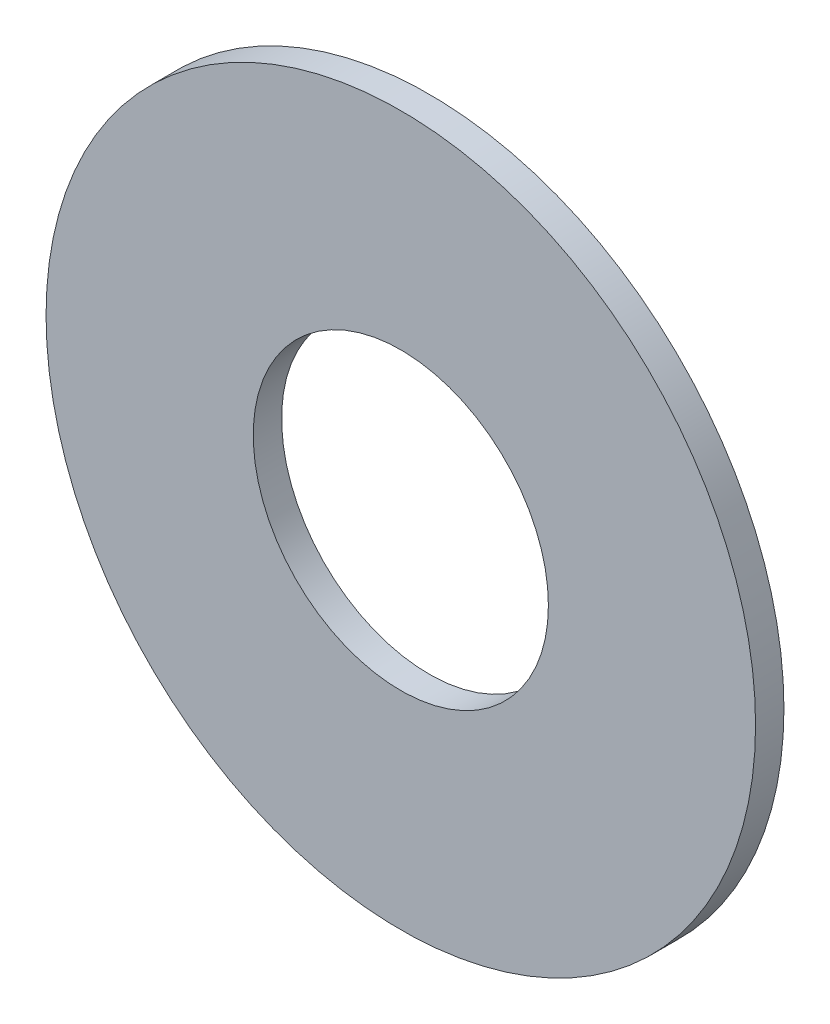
ISO-10303-21;
HEADER;
FILE_DESCRIPTION(('STEP AP214'),'2;1');
FILE_NAME('part.step','',(''),(''),'','','');
FILE_SCHEMA(('AUTOMOTIVE_DESIGN { 1 0 10303 214 1 1 1 1 }'));
ENDSEC;
DATA;
#1=APPLICATION_CONTEXT('core data for automotive mechanical design processes');
#2=APPLICATION_PROTOCOL_DEFINITION('international standard','automotive_design',2000,#1);
#3=PRODUCT_CONTEXT('',#1,'mechanical');
#4=PRODUCT('Part','Part','',(#3));
#5=PRODUCT_RELATED_PRODUCT_CATEGORY('part','',(#4));
#6=PRODUCT_DEFINITION_FORMATION('','',#4);
#7=PRODUCT_DEFINITION_CONTEXT('part definition',#1,'design');
#8=PRODUCT_DEFINITION('design','',#6,#7);
#9=PRODUCT_DEFINITION_SHAPE('','',#8);
#10=(LENGTH_UNIT() NAMED_UNIT(*) SI_UNIT(.MILLI.,.METRE.));
#11=(NAMED_UNIT(*) PLANE_ANGLE_UNIT() SI_UNIT($,.RADIAN.));
#12=(NAMED_UNIT(*) SI_UNIT($,.STERADIAN.) SOLID_ANGLE_UNIT());
#13=UNCERTAINTY_MEASURE_WITH_UNIT(LENGTH_MEASURE(1.E-05),#10,'distance_accuracy_value','');
#14=(GEOMETRIC_REPRESENTATION_CONTEXT(3) GLOBAL_UNCERTAINTY_ASSIGNED_CONTEXT((#13)) GLOBAL_UNIT_ASSIGNED_CONTEXT((#10,
#11,#12)) REPRESENTATION_CONTEXT('',''));
#15=CARTESIAN_POINT('',(0.,0.,0.));
#16=DIRECTION('',(0.,0.,1.));
#17=DIRECTION('',(1.,0.,0.));
#18=AXIS2_PLACEMENT_3D('',#15,#16,#17);
#19=CARTESIAN_POINT('',(0.,0.,-0.762));
#20=DIRECTION('',(0.,0.,1.));
#21=DIRECTION('',(1.,0.,0.));
#22=AXIS2_PLACEMENT_3D('',#19,#20,#21);
#23=CYLINDRICAL_SURFACE('',#22,9.525);
#24=CARTESIAN_POINT('',(0.,0.,-0.762));
#25=DIRECTION('',(0.,0.,1.));
#26=DIRECTION('',(1.,0.,0.));
#27=AXIS2_PLACEMENT_3D('',#24,#25,#26);
#28=CIRCLE('',#27,9.525);
#29=CARTESIAN_POINT('',(9.525,0.,-0.762));
#30=VERTEX_POINT('',#29);
#31=EDGE_CURVE('E10',#30,#30,#28,.T.);
#32=CARTESIAN_POINT('',(0.,0.,0.));
#33=DIRECTION('',(0.,0.,1.));
#34=DIRECTION('',(1.,0.,0.));
#35=AXIS2_PLACEMENT_3D('',#32,#33,#34);
#36=CIRCLE('',#35,9.525);
#37=CARTESIAN_POINT('',(9.525,0.,0.));
#38=VERTEX_POINT('',#37);
#39=EDGE_CURVE('E34',#38,#38,#36,.T.);
#40=CARTESIAN_POINT('',(9.525,0.,-0.762));
#41=CARTESIAN_POINT('',(9.525,0.,-0.7540625));
#42=CARTESIAN_POINT('',(9.525,0.,-0.746125));
#43=CARTESIAN_POINT('',(9.525,0.,-0.73025));
#44=CARTESIAN_POINT('',(9.525,0.,-0.7223125));
#45=CARTESIAN_POINT('',(9.525,0.,-0.7064375));
#46=CARTESIAN_POINT('',(9.525,0.,-0.6985));
#47=CARTESIAN_POINT('',(9.525,0.,-0.682625));
#48=CARTESIAN_POINT('',(9.525,0.,-0.6746875));
#49=CARTESIAN_POINT('',(9.525,0.,-0.6588125));
#50=CARTESIAN_POINT('',(9.525,0.,-0.650875));
#51=CARTESIAN_POINT('',(9.525,0.,-0.635));
#52=CARTESIAN_POINT('',(9.525,0.,-0.6270625));
#53=CARTESIAN_POINT('',(9.525,0.,-0.6111875));
#54=CARTESIAN_POINT('',(9.525,0.,-0.60325));
#55=CARTESIAN_POINT('',(9.525,0.,-0.587375));
#56=CARTESIAN_POINT('',(9.525,0.,-0.5794375));
#57=CARTESIAN_POINT('',(9.525,0.,-0.5635625));
#58=CARTESIAN_POINT('',(9.525,0.,-0.555625));
#59=CARTESIAN_POINT('',(9.525,0.,-0.53975));
#60=CARTESIAN_POINT('',(9.525,0.,-0.5318125));
#61=CARTESIAN_POINT('',(9.525,0.,-0.5159375));
#62=CARTESIAN_POINT('',(9.525,0.,-0.508));
#63=CARTESIAN_POINT('',(9.525,0.,-0.492125));
#64=CARTESIAN_POINT('',(9.525,0.,-0.4841875));
#65=CARTESIAN_POINT('',(9.525,0.,-0.4683125));
#66=CARTESIAN_POINT('',(9.525,0.,-0.460375));
#67=CARTESIAN_POINT('',(9.525,0.,-0.4445));
#68=CARTESIAN_POINT('',(9.525,0.,-0.4365625));
#69=CARTESIAN_POINT('',(9.525,0.,-0.4206875));
#70=CARTESIAN_POINT('',(9.525,0.,-0.41275));
#71=CARTESIAN_POINT('',(9.525,0.,-0.396875));
#72=CARTESIAN_POINT('',(9.525,0.,-0.3889375));
#73=CARTESIAN_POINT('',(9.525,0.,-0.3730625));
#74=CARTESIAN_POINT('',(9.525,0.,-0.365125));
#75=CARTESIAN_POINT('',(9.525,0.,-0.34925));
#76=CARTESIAN_POINT('',(9.525,0.,-0.3413125));
#77=CARTESIAN_POINT('',(9.525,0.,-0.3254375));
#78=CARTESIAN_POINT('',(9.525,0.,-0.3175));
#79=CARTESIAN_POINT('',(9.525,0.,-0.301625));
#80=CARTESIAN_POINT('',(9.525,0.,-0.2936875));
#81=CARTESIAN_POINT('',(9.525,0.,-0.2778125));
#82=CARTESIAN_POINT('',(9.525,0.,-0.269875));
#83=CARTESIAN_POINT('',(9.525,0.,-0.254));
#84=CARTESIAN_POINT('',(9.525,0.,-0.2460625));
#85=CARTESIAN_POINT('',(9.525,0.,-0.2301875));
#86=CARTESIAN_POINT('',(9.525,0.,-0.22225));
#87=CARTESIAN_POINT('',(9.525,0.,-0.206375));
#88=CARTESIAN_POINT('',(9.525,0.,-0.1984375));
#89=CARTESIAN_POINT('',(9.525,0.,-0.1825625));
#90=CARTESIAN_POINT('',(9.525,0.,-0.174625));
#91=CARTESIAN_POINT('',(9.525,0.,-0.15875));
#92=CARTESIAN_POINT('',(9.525,0.,-0.1508125));
#93=CARTESIAN_POINT('',(9.525,0.,-0.1349375));
#94=CARTESIAN_POINT('',(9.525,0.,-0.127));
#95=CARTESIAN_POINT('',(9.525,0.,-0.111125));
#96=CARTESIAN_POINT('',(9.525,0.,-0.1031875));
#97=CARTESIAN_POINT('',(9.525,0.,-0.0873125));
#98=CARTESIAN_POINT('',(9.525,0.,-0.079375));
#99=CARTESIAN_POINT('',(9.525,0.,-0.0635));
#100=CARTESIAN_POINT('',(9.525,0.,-0.0555625));
#101=CARTESIAN_POINT('',(9.525,0.,-0.0396875));
#102=CARTESIAN_POINT('',(9.525,0.,-0.03175));
#103=CARTESIAN_POINT('',(9.525,0.,-0.015875));
#104=CARTESIAN_POINT('',(9.525,0.,-0.00793749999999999));
#105=CARTESIAN_POINT('',(9.525,0.,0.));
#106=B_SPLINE_CURVE_WITH_KNOTS('',3,(#40,#41,#42,#43,#44,#45,#46,#47,#48,#49,#50,#51,#52,#53,
#54,#55,#56,#57,#58,#59,#60,#61,#62,#63,#64,#65,#66,#67,#68,#69,#70,#71,#72,#73,#74,#75,#76,#77,
#78,#79,#80,#81,#82,#83,#84,#85,#86,#87,#88,#89,#90,#91,#92,#93,#94,#95,#96,#97,#98,#99,#100,
#101,#102,#103,#104,#105),.UNSPECIFIED.,.F.,.F.,(4,2,2,2,2,2,2,2,2,2,2,2,2,2,2,2,2,2,2,2,2,2,2,
2,2,2,2,2,2,2,2,2,4),(0.,0.0238125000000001,0.047625,0.0714375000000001,0.0952500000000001,
0.1190625,0.142875,0.1666875,0.1905,0.2143125,0.238125,0.2619375,0.28575,0.3095625,0.333375,
0.3571875,0.381,0.4048125,0.428625,0.4524375,0.47625,0.5000625,0.523875,0.5476875,0.5715,
0.5953125,0.619125,0.6429375,0.66675,0.6905625,0.714375,0.7381875,0.762),.UNSPECIFIED.);
#107=EDGE_CURVE('BSEAM28',#30,#38,#106,.T.);
#108=ORIENTED_EDGE('',*,*,#31,.T.);
#109=ORIENTED_EDGE('',*,*,#39,.F.);
#110=ORIENTED_EDGE('',*,*,#107,.T.);
#111=ORIENTED_EDGE('',*,*,#107,.F.);
#112=EDGE_LOOP('',(#108,#110,#109,#111));
#113=FACE_BOUND('',#112,.T.);
#114=ADVANCED_FACE('F28',(#113),#23,.T.);
#115=CARTESIAN_POINT('',(0.,0.,-0.762));
#116=DIRECTION('',(0.,0.,1.));
#117=DIRECTION('',(1.,0.,0.));
#118=AXIS2_PLACEMENT_3D('',#115,#116,#117);
#119=PLANE('',#118);
#120=CARTESIAN_POINT('',(0.,0.,-0.762));
#121=DIRECTION('',(0.,0.,1.));
#122=DIRECTION('',(1.,0.,0.));
#123=AXIS2_PLACEMENT_3D('',#120,#121,#122);
#124=CIRCLE('',#123,3.9624);
#125=CARTESIAN_POINT('',(3.9624,0.,-0.762));
#126=VERTEX_POINT('',#125);
#127=EDGE_CURVE('E38',#126,#126,#124,.T.);
#128=ORIENTED_EDGE('',*,*,#127,.T.);
#129=EDGE_LOOP('',(#128));
#130=FACE_BOUND('',#129,.T.);
#131=ORIENTED_EDGE('',*,*,#31,.F.);
#132=EDGE_LOOP('',(#131));
#133=FACE_BOUND('',#132,.T.);
#134=ADVANCED_FACE('F52',(#130,#133),#119,.F.);
#135=CARTESIAN_POINT('',(0.,0.,0.));
#136=DIRECTION('',(0.,0.,1.));
#137=DIRECTION('',(1.,0.,0.));
#138=AXIS2_PLACEMENT_3D('',#135,#136,#137);
#139=PLANE('',#138);
#140=CARTESIAN_POINT('',(0.,0.,0.));
#141=DIRECTION('',(0.,0.,1.));
#142=DIRECTION('',(1.,0.,0.));
#143=AXIS2_PLACEMENT_3D('',#140,#141,#142);
#144=CIRCLE('',#143,3.9624);
#145=CARTESIAN_POINT('',(3.9624,0.,0.));
#146=VERTEX_POINT('',#145);
#147=EDGE_CURVE('E42',#146,#146,#144,.T.);
#148=ORIENTED_EDGE('',*,*,#147,.F.);
#149=EDGE_LOOP('',(#148));
#150=FACE_BOUND('',#149,.T.);
#151=ORIENTED_EDGE('',*,*,#39,.T.);
#152=EDGE_LOOP('',(#151));
#153=FACE_BOUND('',#152,.T.);
#154=ADVANCED_FACE('F50',(#150,#153),#139,.T.);
#155=CARTESIAN_POINT('',(0.,0.,-0.762));
#156=DIRECTION('',(0.,0.,1.));
#157=DIRECTION('',(1.,0.,0.));
#158=AXIS2_PLACEMENT_3D('',#155,#156,#157);
#159=CYLINDRICAL_SURFACE('',#158,3.9624);
#160=CARTESIAN_POINT('',(3.9624,0.,-0.762));
#161=CARTESIAN_POINT('',(3.9624,0.,-0.7540625));
#162=CARTESIAN_POINT('',(3.9624,0.,-0.746125));
#163=CARTESIAN_POINT('',(3.9624,0.,-0.73025));
#164=CARTESIAN_POINT('',(3.9624,0.,-0.7223125));
#165=CARTESIAN_POINT('',(3.9624,0.,-0.7064375));
#166=CARTESIAN_POINT('',(3.9624,0.,-0.6985));
#167=CARTESIAN_POINT('',(3.9624,0.,-0.682625));
#168=CARTESIAN_POINT('',(3.9624,0.,-0.6746875));
#169=CARTESIAN_POINT('',(3.9624,0.,-0.6588125));
#170=CARTESIAN_POINT('',(3.9624,0.,-0.650875));
#171=CARTESIAN_POINT('',(3.9624,0.,-0.635));
#172=CARTESIAN_POINT('',(3.9624,0.,-0.6270625));
#173=CARTESIAN_POINT('',(3.9624,0.,-0.6111875));
#174=CARTESIAN_POINT('',(3.9624,0.,-0.60325));
#175=CARTESIAN_POINT('',(3.9624,0.,-0.587375));
#176=CARTESIAN_POINT('',(3.9624,0.,-0.5794375));
#177=CARTESIAN_POINT('',(3.9624,0.,-0.5635625));
#178=CARTESIAN_POINT('',(3.9624,0.,-0.555625));
#179=CARTESIAN_POINT('',(3.9624,0.,-0.53975));
#180=CARTESIAN_POINT('',(3.9624,0.,-0.5318125));
#181=CARTESIAN_POINT('',(3.9624,0.,-0.5159375));
#182=CARTESIAN_POINT('',(3.9624,0.,-0.508));
#183=CARTESIAN_POINT('',(3.9624,0.,-0.492125));
#184=CARTESIAN_POINT('',(3.9624,0.,-0.4841875));
#185=CARTESIAN_POINT('',(3.9624,0.,-0.4683125));
#186=CARTESIAN_POINT('',(3.9624,0.,-0.460375));
#187=CARTESIAN_POINT('',(3.9624,0.,-0.4445));
#188=CARTESIAN_POINT('',(3.9624,0.,-0.4365625));
#189=CARTESIAN_POINT('',(3.9624,0.,-0.4206875));
#190=CARTESIAN_POINT('',(3.9624,0.,-0.41275));
#191=CARTESIAN_POINT('',(3.9624,0.,-0.396875));
#192=CARTESIAN_POINT('',(3.9624,0.,-0.3889375));
#193=CARTESIAN_POINT('',(3.9624,0.,-0.3730625));
#194=CARTESIAN_POINT('',(3.9624,0.,-0.365125));
#195=CARTESIAN_POINT('',(3.9624,0.,-0.34925));
#196=CARTESIAN_POINT('',(3.9624,0.,-0.3413125));
#197=CARTESIAN_POINT('',(3.9624,0.,-0.3254375));
#198=CARTESIAN_POINT('',(3.9624,0.,-0.3175));
#199=CARTESIAN_POINT('',(3.9624,0.,-0.301625));
#200=CARTESIAN_POINT('',(3.9624,0.,-0.2936875));
#201=CARTESIAN_POINT('',(3.9624,0.,-0.2778125));
#202=CARTESIAN_POINT('',(3.9624,0.,-0.269875));
#203=CARTESIAN_POINT('',(3.9624,0.,-0.254));
#204=CARTESIAN_POINT('',(3.9624,0.,-0.2460625));
#205=CARTESIAN_POINT('',(3.9624,0.,-0.2301875));
#206=CARTESIAN_POINT('',(3.9624,0.,-0.22225));
#207=CARTESIAN_POINT('',(3.9624,0.,-0.206375));
#208=CARTESIAN_POINT('',(3.9624,0.,-0.1984375));
#209=CARTESIAN_POINT('',(3.9624,0.,-0.1825625));
#210=CARTESIAN_POINT('',(3.9624,0.,-0.174625));
#211=CARTESIAN_POINT('',(3.9624,0.,-0.15875));
#212=CARTESIAN_POINT('',(3.9624,0.,-0.1508125));
#213=CARTESIAN_POINT('',(3.9624,0.,-0.1349375));
#214=CARTESIAN_POINT('',(3.9624,0.,-0.127));
#215=CARTESIAN_POINT('',(3.9624,0.,-0.111125));
#216=CARTESIAN_POINT('',(3.9624,0.,-0.1031875));
#217=CARTESIAN_POINT('',(3.9624,0.,-0.0873125));
#218=CARTESIAN_POINT('',(3.9624,0.,-0.079375));
#219=CARTESIAN_POINT('',(3.9624,0.,-0.0635));
#220=CARTESIAN_POINT('',(3.9624,0.,-0.0555625));
#221=CARTESIAN_POINT('',(3.9624,0.,-0.0396875));
#222=CARTESIAN_POINT('',(3.9624,0.,-0.03175));
#223=CARTESIAN_POINT('',(3.9624,0.,-0.015875));
#224=CARTESIAN_POINT('',(3.9624,0.,-0.00793749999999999));
#225=CARTESIAN_POINT('',(3.9624,0.,0.));
#226=B_SPLINE_CURVE_WITH_KNOTS('',3,(#160,#161,#162,#163,#164,#165,#166,#167,#168,#169,#170,
#171,#172,#173,#174,#175,#176,#177,#178,#179,#180,#181,#182,#183,#184,#185,#186,#187,#188,#189,
#190,#191,#192,#193,#194,#195,#196,#197,#198,#199,#200,#201,#202,#203,#204,#205,#206,#207,#208,
#209,#210,#211,#212,#213,#214,#215,#216,#217,#218,#219,#220,#221,#222,#223,#224,#225),
.UNSPECIFIED.,.F.,.F.,(4,2,2,2,2,2,2,2,2,2,2,2,2,2,2,2,2,2,2,2,2,2,2,2,2,2,2,2,2,2,2,2,4),(0.,
0.0238125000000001,0.047625,0.0714375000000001,0.0952500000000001,0.1190625,0.142875,0.1666875,
0.1905,0.2143125,0.238125,0.2619375,0.28575,0.3095625,0.333375,0.3571875,0.381,0.4048125,
0.428625,0.4524375,0.47625,0.5000625,0.523875,0.5476875,0.5715,0.5953125,0.619125,0.6429375,
0.66675,0.6905625,0.714375,0.7381875,0.762),.UNSPECIFIED.);
#227=EDGE_CURVE('BSEAM48',#126,#146,#226,.T.);
#228=ORIENTED_EDGE('',*,*,#127,.F.);
#229=ORIENTED_EDGE('',*,*,#147,.T.);
#230=ORIENTED_EDGE('',*,*,#227,.T.);
#231=ORIENTED_EDGE('',*,*,#227,.F.);
#232=EDGE_LOOP('',(#228,#230,#229,#231));
#233=FACE_BOUND('',#232,.T.);
#234=ADVANCED_FACE('F48',(#233),#159,.F.);
#235=CLOSED_SHELL('',(#114,#134,#154,#234));
#236=MANIFOLD_SOLID_BREP('B2',#235);
#237=ADVANCED_BREP_SHAPE_REPRESENTATION('',(#18,#236),#14);
#238=SHAPE_DEFINITION_REPRESENTATION(#9,#237);
ENDSEC;
END-ISO-10303-21;
